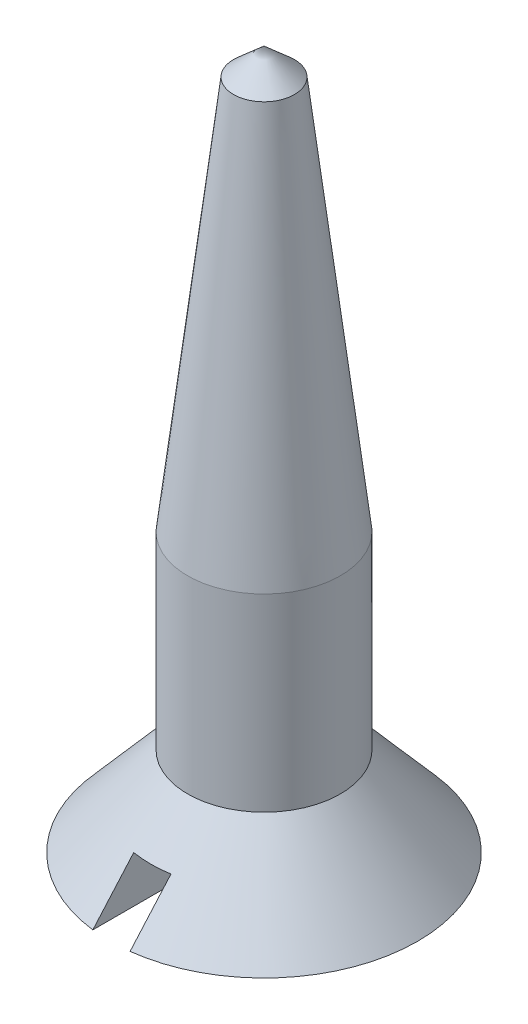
from build123d import *

# Parameters (mm, degrees)
CUT_EXTRUDE1_DEPTH      = 20.950725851
CUT_EXTRUDE1_DEPTH_BACK = 20.950725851
SKETCH4_W               = 1.016
SKETCH4_H               = 2.54


with BuildPart() as part:
    # Sketch1 → Revolve1 (revolve)
    with BuildSketch(Plane.XY, mode=Mode.PRIVATE) as revolve1_sk:
        Polygon((0, 0), (0, 19.05), (-0.829579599, 18.318143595), (-2.0828, 7.578371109), (-2.0828, 2.425206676), (-4.191, 0), align=None)
    revolve(revolve1_sk.sketch.rotate(Axis((0, 0, 0), (0, 1, 0)), 270), axis=Axis((0, 0, 0), (0, 1, 0)))

    # Sketch4 → Cut-Extrude1 (cut, two sides: drawn at the far end of the back side and taken through both)
    with BuildSketch(Plane.XY.offset(-CUT_EXTRUDE1_DEPTH_BACK)):
        Rectangle(SKETCH4_W, SKETCH4_H)
    extrude(amount=CUT_EXTRUDE1_DEPTH + CUT_EXTRUDE1_DEPTH_BACK, mode=Mode.SUBTRACT)


solid = part.part
